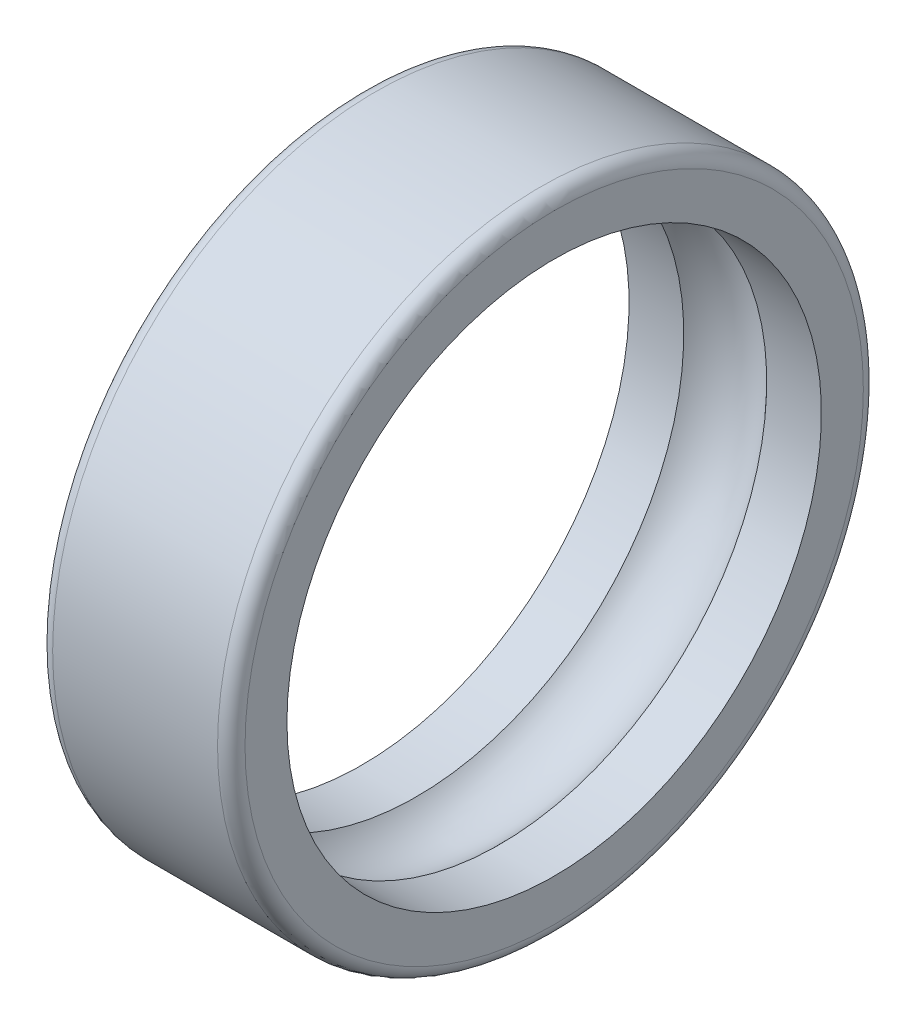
from build123d import *


with BuildPart() as part:
    # Esquisse1 → Base-R_volution (revolve)
    with BuildSketch(Plane(origin=(0, 0, 0), x_dir=(1, 0, 0), z_dir=(0, 1, 0)), mode=Mode.PRIVATE) as base_r_volution_sk:
        with BuildLine():
            Line((0, 22.5), (0, 19.45))
            Line((0, 19.45), (3.98130823, 19.45))
            ThreePointArc((3.98130823, 19.45), (7, 20.8), (10.01869177, 19.45))
            Line((10.01869177, 19.45), (14, 19.45))
            Line((14, 19.45), (14, 22.5))
            ThreePointArc((14, 22.5), (13.707106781, 23.207106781), (13, 23.5))
            Line((13, 23.5), (1, 23.5))
            ThreePointArc((1, 23.5), (0.292893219, 23.207106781), (0, 22.5))
        make_face()
    revolve(base_r_volution_sk.sketch.rotate(Axis((0, 0, 0), (1, 0, 0)), 180), axis=Axis((0, 0, 0), (1, 0, 0)))


solid = part.part
